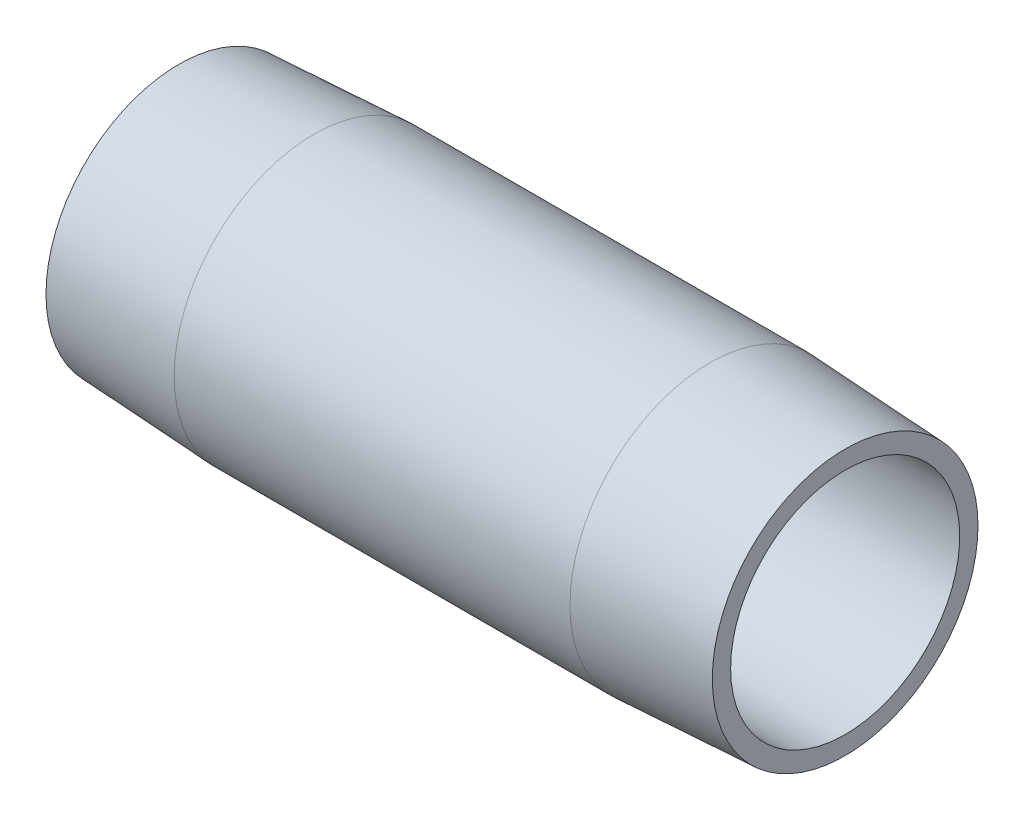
ISO-10303-21;
HEADER;
FILE_DESCRIPTION(('STEP AP214'),'2;1');
FILE_NAME('part.step','',(''),(''),'','','');
FILE_SCHEMA(('AUTOMOTIVE_DESIGN { 1 0 10303 214 1 1 1 1 }'));
ENDSEC;
DATA;
#1=APPLICATION_CONTEXT('core data for automotive mechanical design processes');
#2=APPLICATION_PROTOCOL_DEFINITION('international standard','automotive_design',2000,#1);
#3=PRODUCT_CONTEXT('',#1,'mechanical');
#4=PRODUCT('Part','Part','',(#3));
#5=PRODUCT_RELATED_PRODUCT_CATEGORY('part','',(#4));
#6=PRODUCT_DEFINITION_FORMATION('','',#4);
#7=PRODUCT_DEFINITION_CONTEXT('part definition',#1,'design');
#8=PRODUCT_DEFINITION('design','',#6,#7);
#9=PRODUCT_DEFINITION_SHAPE('','',#8);
#10=(LENGTH_UNIT() NAMED_UNIT(*) SI_UNIT(.MILLI.,.METRE.));
#11=(NAMED_UNIT(*) PLANE_ANGLE_UNIT() SI_UNIT($,.RADIAN.));
#12=(NAMED_UNIT(*) SI_UNIT($,.STERADIAN.) SOLID_ANGLE_UNIT());
#13=UNCERTAINTY_MEASURE_WITH_UNIT(LENGTH_MEASURE(1.E-05),#10,'distance_accuracy_value','');
#14=(GEOMETRIC_REPRESENTATION_CONTEXT(3) GLOBAL_UNCERTAINTY_ASSIGNED_CONTEXT((#13)) GLOBAL_UNIT_ASSIGNED_CONTEXT((#10,
#11,#12)) REPRESENTATION_CONTEXT('',''));
#15=CARTESIAN_POINT('',(0.,0.,0.));
#16=DIRECTION('',(0.,0.,1.));
#17=DIRECTION('',(1.,0.,0.));
#18=AXIS2_PLACEMENT_3D('',#15,#16,#17);
#19=CARTESIAN_POINT('',(50.8,8.73125,0.));
#20=DIRECTION('',(-1.,0.,0.));
#21=DIRECTION('',(0.,0.,1.));
#22=AXIS2_PLACEMENT_3D('',#19,#20,#21);
#23=PLANE('',#22);
#24=CARTESIAN_POINT('',(50.8,0.,0.));
#25=DIRECTION('',(-1.,0.,0.));
#26=DIRECTION('',(0.,0.,1.));
#27=AXIS2_PLACEMENT_3D('',#24,#25,#26);
#28=CIRCLE('',#27,10.1275500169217);
#29=CARTESIAN_POINT('',(50.8,0.,10.1275500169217));
#30=VERTEX_POINT('',#29);
#31=EDGE_CURVE('E10',#30,#30,#28,.T.);
#32=ORIENTED_EDGE('',*,*,#31,.F.);
#33=EDGE_LOOP('',(#32));
#34=FACE_BOUND('',#33,.T.);
#35=CARTESIAN_POINT('',(50.8,0.,0.));
#36=DIRECTION('',(-1.,0.,0.));
#37=DIRECTION('',(0.,0.,1.));
#38=AXIS2_PLACEMENT_3D('',#35,#36,#37);
#39=CIRCLE('',#38,8.73125);
#40=CARTESIAN_POINT('',(50.8,0.,8.73125));
#41=VERTEX_POINT('',#40);
#42=EDGE_CURVE('E52',#41,#41,#39,.T.);
#43=ORIENTED_EDGE('',*,*,#42,.T.);
#44=EDGE_LOOP('',(#43));
#45=FACE_BOUND('',#44,.T.);
#46=ADVANCED_FACE('F30',(#34,#45),#23,.F.);
#47=CARTESIAN_POINT('',(50.8,0.,0.));
#48=DIRECTION('',(-1.,0.,0.));
#49=DIRECTION('',(0.,0.,1.));
#50=AXIS2_PLACEMENT_3D('',#47,#48,#49);
#51=CONICAL_SURFACE('',#50,10.1275500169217,0.0523598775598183);
#52=CARTESIAN_POINT('',(40.4876,0.,0.));
#53=DIRECTION('',(-1.,0.,0.));
#54=DIRECTION('',(0.,0.,1.));
#55=AXIS2_PLACEMENT_3D('',#52,#53,#54);
#56=CIRCLE('',#55,10.668);
#57=CARTESIAN_POINT('',(40.4876,0.,10.668));
#58=VERTEX_POINT('',#57);
#59=EDGE_CURVE('E36',#58,#58,#56,.T.);
#60=ORIENTED_EDGE('',*,*,#59,.F.);
#61=EDGE_LOOP('',(#60));
#62=FACE_BOUND('',#61,.T.);
#63=ORIENTED_EDGE('',*,*,#31,.T.);
#64=EDGE_LOOP('',(#63));
#65=FACE_BOUND('',#64,.T.);
#66=ADVANCED_FACE('F77',(#62,#65),#51,.T.);
#67=CARTESIAN_POINT('',(0.,0.,0.));
#68=DIRECTION('',(-1.,0.,0.));
#69=DIRECTION('',(0.,0.,1.));
#70=AXIS2_PLACEMENT_3D('',#67,#68,#69);
#71=CYLINDRICAL_SURFACE('',#70,10.668);
#72=CARTESIAN_POINT('',(10.3124,0.,0.));
#73=DIRECTION('',(-1.,0.,0.));
#74=DIRECTION('',(0.,0.,1.));
#75=AXIS2_PLACEMENT_3D('',#72,#73,#74);
#76=CIRCLE('',#75,10.668);
#77=CARTESIAN_POINT('',(10.3124,0.,10.668));
#78=VERTEX_POINT('',#77);
#79=EDGE_CURVE('E40',#78,#78,#76,.T.);
#80=ORIENTED_EDGE('',*,*,#79,.F.);
#81=EDGE_LOOP('',(#80));
#82=FACE_BOUND('',#81,.T.);
#83=ORIENTED_EDGE('',*,*,#59,.T.);
#84=EDGE_LOOP('',(#83));
#85=FACE_BOUND('',#84,.T.);
#86=ADVANCED_FACE('F72',(#82,#85),#71,.T.);
#87=CARTESIAN_POINT('',(10.3124,0.,0.));
#88=DIRECTION('',(1.,0.,0.));
#89=DIRECTION('',(0.,0.,-1.));
#90=AXIS2_PLACEMENT_3D('',#87,#88,#89);
#91=CONICAL_SURFACE('',#90,10.668,0.0523598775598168);
#92=CARTESIAN_POINT('',(0.,0.,0.));
#93=DIRECTION('',(-1.,0.,0.));
#94=DIRECTION('',(0.,0.,1.));
#95=AXIS2_PLACEMENT_3D('',#92,#93,#94);
#96=CIRCLE('',#95,10.1275500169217);
#97=CARTESIAN_POINT('',(0.,0.,10.1275500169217));
#98=VERTEX_POINT('',#97);
#99=EDGE_CURVE('E44',#98,#98,#96,.T.);
#100=ORIENTED_EDGE('',*,*,#99,.F.);
#101=EDGE_LOOP('',(#100));
#102=FACE_BOUND('',#101,.T.);
#103=ORIENTED_EDGE('',*,*,#79,.T.);
#104=EDGE_LOOP('',(#103));
#105=FACE_BOUND('',#104,.T.);
#106=ADVANCED_FACE('F66',(#102,#105),#91,.T.);
#107=CARTESIAN_POINT('',(0.,10.1275500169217,0.));
#108=DIRECTION('',(1.,0.,0.));
#109=DIRECTION('',(0.,0.,-1.));
#110=AXIS2_PLACEMENT_3D('',#107,#108,#109);
#111=PLANE('',#110);
#112=CARTESIAN_POINT('',(0.,0.,0.));
#113=DIRECTION('',(-1.,0.,0.));
#114=DIRECTION('',(0.,0.,1.));
#115=AXIS2_PLACEMENT_3D('',#112,#113,#114);
#116=CIRCLE('',#115,8.73125);
#117=CARTESIAN_POINT('',(0.,0.,8.73125));
#118=VERTEX_POINT('',#117);
#119=EDGE_CURVE('E49',#118,#118,#116,.T.);
#120=ORIENTED_EDGE('',*,*,#119,.F.);
#121=EDGE_LOOP('',(#120));
#122=FACE_BOUND('',#121,.T.);
#123=ORIENTED_EDGE('',*,*,#99,.T.);
#124=EDGE_LOOP('',(#123));
#125=FACE_BOUND('',#124,.T.);
#126=ADVANCED_FACE('F60',(#122,#125),#111,.F.);
#127=CARTESIAN_POINT('',(0.,0.,0.));
#128=DIRECTION('',(-1.,0.,0.));
#129=DIRECTION('',(0.,0.,1.));
#130=AXIS2_PLACEMENT_3D('',#127,#128,#129);
#131=CYLINDRICAL_SURFACE('',#130,8.73125);
#132=ORIENTED_EDGE('',*,*,#42,.F.);
#133=EDGE_LOOP('',(#132));
#134=FACE_BOUND('',#133,.T.);
#135=ORIENTED_EDGE('',*,*,#119,.T.);
#136=EDGE_LOOP('',(#135));
#137=FACE_BOUND('',#136,.T.);
#138=ADVANCED_FACE('F57',(#134,#137),#131,.F.);
#139=CLOSED_SHELL('',(#46,#66,#86,#106,#126,#138));
#140=MANIFOLD_SOLID_BREP('B2',#139);
#141=ADVANCED_BREP_SHAPE_REPRESENTATION('',(#18,#140),#14);
#142=SHAPE_DEFINITION_REPRESENTATION(#9,#141);
ENDSEC;
END-ISO-10303-21;
